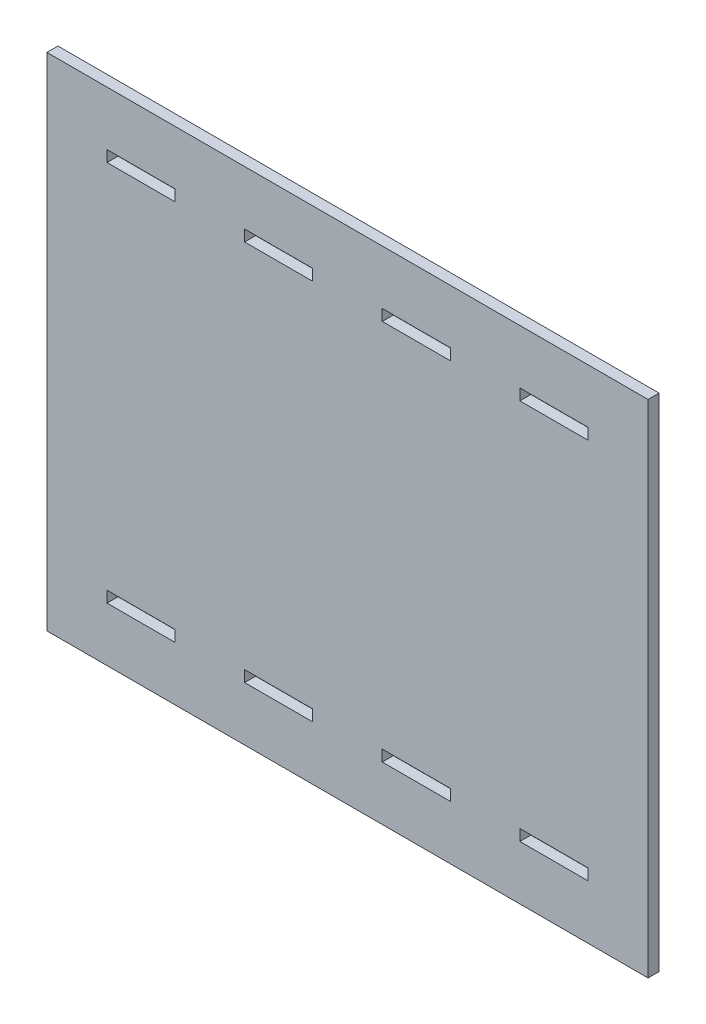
ISO-10303-21;
HEADER;
FILE_DESCRIPTION(('STEP AP214'),'2;1');
FILE_NAME('part.step','',(''),(''),'','','');
FILE_SCHEMA(('AUTOMOTIVE_DESIGN { 1 0 10303 214 1 1 1 1 }'));
ENDSEC;
DATA;
#1=APPLICATION_CONTEXT('core data for automotive mechanical design processes');
#2=APPLICATION_PROTOCOL_DEFINITION('international standard','automotive_design',2000,#1);
#3=PRODUCT_CONTEXT('',#1,'mechanical');
#4=PRODUCT('Part','Part','',(#3));
#5=PRODUCT_RELATED_PRODUCT_CATEGORY('part','',(#4));
#6=PRODUCT_DEFINITION_FORMATION('','',#4);
#7=PRODUCT_DEFINITION_CONTEXT('part definition',#1,'design');
#8=PRODUCT_DEFINITION('design','',#6,#7);
#9=PRODUCT_DEFINITION_SHAPE('','',#8);
#10=(LENGTH_UNIT() NAMED_UNIT(*) SI_UNIT(.MILLI.,.METRE.));
#11=(NAMED_UNIT(*) PLANE_ANGLE_UNIT() SI_UNIT($,.RADIAN.));
#12=(NAMED_UNIT(*) SI_UNIT($,.STERADIAN.) SOLID_ANGLE_UNIT());
#13=UNCERTAINTY_MEASURE_WITH_UNIT(LENGTH_MEASURE(1.E-05),#10,'distance_accuracy_value','');
#14=(GEOMETRIC_REPRESENTATION_CONTEXT(3) GLOBAL_UNCERTAINTY_ASSIGNED_CONTEXT((#13)) GLOBAL_UNIT_ASSIGNED_CONTEXT((#10,
#11,#12)) REPRESENTATION_CONTEXT('',''));
#15=CARTESIAN_POINT('',(0.,0.,0.));
#16=DIRECTION('',(0.,0.,1.));
#17=DIRECTION('',(1.,0.,0.));
#18=AXIS2_PLACEMENT_3D('',#15,#16,#17);
#19=CARTESIAN_POINT('',(150.,125.,5.5));
#20=DIRECTION('',(-1.,0.,0.));
#21=DIRECTION('',(0.,0.,1.));
#22=AXIS2_PLACEMENT_3D('',#19,#20,#21);
#23=PLANE('',#22);
#24=DIRECTION('',(0.,1.,0.));
#25=VECTOR('',#24,1.);
#26=CARTESIAN_POINT('',(150.,125.,0.));
#27=LINE('',#26,#25);
#28=CARTESIAN_POINT('',(150.,-125.,0.));
#29=VERTEX_POINT('',#28);
#30=CARTESIAN_POINT('',(150.,125.,0.));
#31=VERTEX_POINT('',#30);
#32=EDGE_CURVE('E527',#29,#31,#27,.T.);
#33=ORIENTED_EDGE('',*,*,#32,.T.);
#34=DIRECTION('',(0.,0.,-1.));
#35=VECTOR('',#34,1.);
#36=CARTESIAN_POINT('',(150.,125.,5.5));
#37=LINE('',#36,#35);
#38=CARTESIAN_POINT('',(150.,125.,5.5));
#39=VERTEX_POINT('',#38);
#40=EDGE_CURVE('E11',#39,#31,#37,.T.);
#41=ORIENTED_EDGE('',*,*,#40,.F.);
#42=DIRECTION('',(0.,1.,0.));
#43=VECTOR('',#42,1.);
#44=CARTESIAN_POINT('',(150.,125.,5.5));
#45=LINE('',#44,#43);
#46=CARTESIAN_POINT('',(150.,-125.,5.5));
#47=VERTEX_POINT('',#46);
#48=EDGE_CURVE('E534',#47,#39,#45,.T.);
#49=ORIENTED_EDGE('',*,*,#48,.F.);
#50=DIRECTION('',(0.,0.,-1.));
#51=VECTOR('',#50,1.);
#52=CARTESIAN_POINT('',(150.,-125.,5.5));
#53=LINE('',#52,#51);
#54=EDGE_CURVE('E544',#47,#29,#53,.T.);
#55=ORIENTED_EDGE('',*,*,#54,.T.);
#56=EDGE_LOOP('',(#33,#41,#49,#55));
#57=FACE_BOUND('',#56,.T.);
#58=ADVANCED_FACE('F42',(#57),#23,.F.);
#59=CARTESIAN_POINT('',(-150.,125.,5.5));
#60=DIRECTION('',(0.,-1.,0.));
#61=DIRECTION('',(0.,0.,-1.));
#62=AXIS2_PLACEMENT_3D('',#59,#60,#61);
#63=PLANE('',#62);
#64=DIRECTION('',(-1.,0.,0.));
#65=VECTOR('',#64,1.);
#66=CARTESIAN_POINT('',(-150.,125.,0.));
#67=LINE('',#66,#65);
#68=CARTESIAN_POINT('',(-150.,125.,0.));
#69=VERTEX_POINT('',#68);
#70=EDGE_CURVE('E547',#31,#69,#67,.T.);
#71=ORIENTED_EDGE('',*,*,#70,.T.);
#72=DIRECTION('',(0.,0.,-1.));
#73=VECTOR('',#72,1.);
#74=CARTESIAN_POINT('',(-150.,125.,5.5));
#75=LINE('',#74,#73);
#76=CARTESIAN_POINT('',(-150.,125.,5.5));
#77=VERTEX_POINT('',#76);
#78=EDGE_CURVE('E49',#77,#69,#75,.T.);
#79=ORIENTED_EDGE('',*,*,#78,.F.);
#80=DIRECTION('',(-1.,0.,0.));
#81=VECTOR('',#80,1.);
#82=CARTESIAN_POINT('',(-150.,125.,5.5));
#83=LINE('',#82,#81);
#84=EDGE_CURVE('E537',#39,#77,#83,.T.);
#85=ORIENTED_EDGE('',*,*,#84,.F.);
#86=ORIENTED_EDGE('',*,*,#40,.T.);
#87=EDGE_LOOP('',(#71,#79,#85,#86));
#88=FACE_BOUND('',#87,.T.);
#89=ADVANCED_FACE('F576',(#88),#63,.F.);
#90=CARTESIAN_POINT('',(-150.,125.,5.5));
#91=DIRECTION('',(1.,0.,0.));
#92=DIRECTION('',(0.,1.,0.));
#93=AXIS2_PLACEMENT_3D('',#90,#91,#92);
#94=PLANE('',#93);
#95=DIRECTION('',(0.,-1.,0.));
#96=VECTOR('',#95,1.);
#97=CARTESIAN_POINT('',(-150.,125.,0.));
#98=LINE('',#97,#96);
#99=CARTESIAN_POINT('',(-150.,-125.,0.));
#100=VERTEX_POINT('',#99);
#101=EDGE_CURVE('E549',#69,#100,#98,.T.);
#102=ORIENTED_EDGE('',*,*,#101,.T.);
#103=DIRECTION('',(0.,0.,-1.));
#104=VECTOR('',#103,1.);
#105=CARTESIAN_POINT('',(-150.,-125.,5.5));
#106=LINE('',#105,#104);
#107=CARTESIAN_POINT('',(-150.,-125.,5.5));
#108=VERTEX_POINT('',#107);
#109=EDGE_CURVE('E554',#108,#100,#106,.T.);
#110=ORIENTED_EDGE('',*,*,#109,.F.);
#111=DIRECTION('',(0.,-1.,0.));
#112=VECTOR('',#111,1.);
#113=CARTESIAN_POINT('',(-150.,125.,5.5));
#114=LINE('',#113,#112);
#115=EDGE_CURVE('E540',#77,#108,#114,.T.);
#116=ORIENTED_EDGE('',*,*,#115,.F.);
#117=ORIENTED_EDGE('',*,*,#78,.T.);
#118=EDGE_LOOP('',(#102,#110,#116,#117));
#119=FACE_BOUND('',#118,.T.);
#120=ADVANCED_FACE('F561',(#119),#94,.F.);
#121=CARTESIAN_POINT('',(-150.,-125.,5.5));
#122=DIRECTION('',(0.,1.,0.));
#123=DIRECTION('',(0.,0.,1.));
#124=AXIS2_PLACEMENT_3D('',#121,#122,#123);
#125=PLANE('',#124);
#126=DIRECTION('',(1.,0.,0.));
#127=VECTOR('',#126,1.);
#128=CARTESIAN_POINT('',(-150.,-125.,0.));
#129=LINE('',#128,#127);
#130=EDGE_CURVE('E538',#100,#29,#129,.T.);
#131=ORIENTED_EDGE('',*,*,#130,.T.);
#132=ORIENTED_EDGE('',*,*,#54,.F.);
#133=DIRECTION('',(1.,0.,0.));
#134=VECTOR('',#133,1.);
#135=CARTESIAN_POINT('',(-150.,-125.,5.5));
#136=LINE('',#135,#134);
#137=EDGE_CURVE('E542',#108,#47,#136,.T.);
#138=ORIENTED_EDGE('',*,*,#137,.F.);
#139=ORIENTED_EDGE('',*,*,#109,.T.);
#140=EDGE_LOOP('',(#131,#132,#138,#139));
#141=FACE_BOUND('',#140,.T.);
#142=ADVANCED_FACE('F570',(#141),#125,.F.);
#143=CARTESIAN_POINT('',(0.,0.,5.5));
#144=DIRECTION('',(0.,0.,1.));
#145=DIRECTION('',(1.,0.,0.));
#146=AXIS2_PLACEMENT_3D('',#143,#144,#145);
#147=PLANE('',#146);
#148=DIRECTION('',(0.,-1.,0.));
#149=VECTOR('',#148,1.);
#150=CARTESIAN_POINT('',(-120.,98.,5.5));
#151=LINE('',#150,#149);
#152=CARTESIAN_POINT('',(-120.,98.,5.5));
#153=VERTEX_POINT('',#152);
#154=CARTESIAN_POINT('',(-120.,92.4,5.5));
#155=VERTEX_POINT('',#154);
#156=EDGE_CURVE('E56',#153,#155,#151,.T.);
#157=ORIENTED_EDGE('',*,*,#156,.F.);
#158=DIRECTION('',(-1.,0.,0.));
#159=VECTOR('',#158,1.);
#160=CARTESIAN_POINT('',(-120.,98.,5.5));
#161=LINE('',#160,#159);
#162=CARTESIAN_POINT('',(-86.,98.,5.5));
#163=VERTEX_POINT('',#162);
#164=EDGE_CURVE('E417',#163,#153,#161,.T.);
#165=ORIENTED_EDGE('',*,*,#164,.F.);
#166=DIRECTION('',(0.,1.,0.));
#167=VECTOR('',#166,1.);
#168=CARTESIAN_POINT('',(-86.,98.,5.5));
#169=LINE('',#168,#167);
#170=CARTESIAN_POINT('',(-86.,92.4,5.5));
#171=VERTEX_POINT('',#170);
#172=EDGE_CURVE('E420',#171,#163,#169,.T.);
#173=ORIENTED_EDGE('',*,*,#172,.F.);
#174=DIRECTION('',(1.,0.,0.));
#175=VECTOR('',#174,1.);
#176=CARTESIAN_POINT('',(-120.,92.4,5.5));
#177=LINE('',#176,#175);
#178=EDGE_CURVE('E424',#155,#171,#177,.T.);
#179=ORIENTED_EDGE('',*,*,#178,.F.);
#180=EDGE_LOOP('',(#157,#165,#173,#179));
#181=FACE_BOUND('',#180,.T.);
#182=DIRECTION('',(0.,-1.,0.));
#183=VECTOR('',#182,1.);
#184=CARTESIAN_POINT('',(86.,-92.3999999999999,5.5));
#185=LINE('',#184,#183);
#186=CARTESIAN_POINT('',(86.,-92.3999999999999,5.5));
#187=VERTEX_POINT('',#186);
#188=CARTESIAN_POINT('',(86.,-97.9999999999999,5.5));
#189=VERTEX_POINT('',#188);
#190=EDGE_CURVE('E64',#187,#189,#185,.T.);
#191=ORIENTED_EDGE('',*,*,#190,.F.);
#192=DIRECTION('',(-1.,0.,0.));
#193=VECTOR('',#192,1.);
#194=CARTESIAN_POINT('',(86.,-92.3999999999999,5.5));
#195=LINE('',#194,#193);
#196=CARTESIAN_POINT('',(120.,-92.3999999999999,5.5));
#197=VERTEX_POINT('',#196);
#198=EDGE_CURVE('E389',#197,#187,#195,.T.);
#199=ORIENTED_EDGE('',*,*,#198,.F.);
#200=DIRECTION('',(0.,1.,0.));
#201=VECTOR('',#200,1.);
#202=CARTESIAN_POINT('',(120.,-92.3999999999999,5.5));
#203=LINE('',#202,#201);
#204=CARTESIAN_POINT('',(120.,-97.9999999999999,5.5));
#205=VERTEX_POINT('',#204);
#206=EDGE_CURVE('E392',#205,#197,#203,.T.);
#207=ORIENTED_EDGE('',*,*,#206,.F.);
#208=DIRECTION('',(1.,0.,0.));
#209=VECTOR('',#208,1.);
#210=CARTESIAN_POINT('',(86.,-97.9999999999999,5.5));
#211=LINE('',#210,#209);
#212=EDGE_CURVE('E396',#189,#205,#211,.T.);
#213=ORIENTED_EDGE('',*,*,#212,.F.);
#214=EDGE_LOOP('',(#191,#199,#207,#213));
#215=FACE_BOUND('',#214,.T.);
#216=DIRECTION('',(0.,-1.,0.));
#217=VECTOR('',#216,1.);
#218=CARTESIAN_POINT('',(17.34,-92.4000000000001,5.5));
#219=LINE('',#218,#217);
#220=CARTESIAN_POINT('',(17.34,-92.4000000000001,5.5));
#221=VERTEX_POINT('',#220);
#222=CARTESIAN_POINT('',(17.34,-98.0000000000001,5.5));
#223=VERTEX_POINT('',#222);
#224=EDGE_CURVE('E448',#221,#223,#219,.T.);
#225=ORIENTED_EDGE('',*,*,#224,.F.);
#226=DIRECTION('',(-1.,0.,0.));
#227=VECTOR('',#226,1.);
#228=CARTESIAN_POINT('',(17.34,-92.4000000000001,5.5));
#229=LINE('',#228,#227);
#230=CARTESIAN_POINT('',(51.34,-92.4000000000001,5.5));
#231=VERTEX_POINT('',#230);
#232=EDGE_CURVE('E481',#231,#221,#229,.T.);
#233=ORIENTED_EDGE('',*,*,#232,.F.);
#234=DIRECTION('',(0.,1.,0.));
#235=VECTOR('',#234,1.);
#236=CARTESIAN_POINT('',(51.34,-92.4000000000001,5.5));
#237=LINE('',#236,#235);
#238=CARTESIAN_POINT('',(51.34,-98.0000000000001,5.5));
#239=VERTEX_POINT('',#238);
#240=EDGE_CURVE('E484',#239,#231,#237,.T.);
#241=ORIENTED_EDGE('',*,*,#240,.F.);
#242=DIRECTION('',(1.,0.,0.));
#243=VECTOR('',#242,1.);
#244=CARTESIAN_POINT('',(17.34,-98.0000000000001,5.5));
#245=LINE('',#244,#243);
#246=EDGE_CURVE('E488',#223,#239,#245,.T.);
#247=ORIENTED_EDGE('',*,*,#246,.F.);
#248=EDGE_LOOP('',(#225,#233,#241,#247));
#249=FACE_BOUND('',#248,.T.);
#250=DIRECTION('',(0.,-1.,0.));
#251=VECTOR('',#250,1.);
#252=CARTESIAN_POINT('',(-120.,-92.3999999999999,5.5));
#253=LINE('',#252,#251);
#254=CARTESIAN_POINT('',(-120.,-92.3999999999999,5.5));
#255=VERTEX_POINT('',#254);
#256=CARTESIAN_POINT('',(-120.,-97.9999999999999,5.5));
#257=VERTEX_POINT('',#256);
#258=EDGE_CURVE('E459',#255,#257,#253,.T.);
#259=ORIENTED_EDGE('',*,*,#258,.F.);
#260=DIRECTION('',(-1.,0.,0.));
#261=VECTOR('',#260,1.);
#262=CARTESIAN_POINT('',(-120.,-92.3999999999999,5.5));
#263=LINE('',#262,#261);
#264=CARTESIAN_POINT('',(-86.,-92.3999999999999,5.5));
#265=VERTEX_POINT('',#264);
#266=EDGE_CURVE('E449',#265,#255,#263,.T.);
#267=ORIENTED_EDGE('',*,*,#266,.F.);
#268=DIRECTION('',(0.,1.,0.));
#269=VECTOR('',#268,1.);
#270=CARTESIAN_POINT('',(-86.,-92.3999999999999,5.5));
#271=LINE('',#270,#269);
#272=CARTESIAN_POINT('',(-86.,-97.9999999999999,5.5));
#273=VERTEX_POINT('',#272);
#274=EDGE_CURVE('E452',#273,#265,#271,.T.);
#275=ORIENTED_EDGE('',*,*,#274,.F.);
#276=DIRECTION('',(1.,0.,0.));
#277=VECTOR('',#276,1.);
#278=CARTESIAN_POINT('',(-120.,-97.9999999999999,5.5));
#279=LINE('',#278,#277);
#280=EDGE_CURVE('E456',#257,#273,#279,.T.);
#281=ORIENTED_EDGE('',*,*,#280,.F.);
#282=EDGE_LOOP('',(#259,#267,#275,#281));
#283=FACE_BOUND('',#282,.T.);
#284=DIRECTION('',(0.,-1.,0.));
#285=VECTOR('',#284,1.);
#286=CARTESIAN_POINT('',(-51.34,98.,5.5));
#287=LINE('',#286,#285);
#288=CARTESIAN_POINT('',(-51.34,98.,5.5));
#289=VERTEX_POINT('',#288);
#290=CARTESIAN_POINT('',(-51.34,92.4,5.5));
#291=VERTEX_POINT('',#290);
#292=EDGE_CURVE('E277',#289,#291,#287,.T.);
#293=ORIENTED_EDGE('',*,*,#292,.F.);
#294=DIRECTION('',(-1.,0.,0.));
#295=VECTOR('',#294,1.);
#296=CARTESIAN_POINT('',(-51.34,98.,5.5));
#297=LINE('',#296,#295);
#298=CARTESIAN_POINT('',(-17.34,98.,5.5));
#299=VERTEX_POINT('',#298);
#300=EDGE_CURVE('E288',#299,#289,#297,.T.);
#301=ORIENTED_EDGE('',*,*,#300,.F.);
#302=DIRECTION('',(0.,1.,0.));
#303=VECTOR('',#302,1.);
#304=CARTESIAN_POINT('',(-17.34,98.,5.5));
#305=LINE('',#304,#303);
#306=CARTESIAN_POINT('',(-17.34,92.4,5.5));
#307=VERTEX_POINT('',#306);
#308=EDGE_CURVE('E293',#307,#299,#305,.T.);
#309=ORIENTED_EDGE('',*,*,#308,.F.);
#310=DIRECTION('',(1.,0.,0.));
#311=VECTOR('',#310,1.);
#312=CARTESIAN_POINT('',(-51.34,92.4,5.5));
#313=LINE('',#312,#311);
#314=EDGE_CURVE('E299',#291,#307,#313,.T.);
#315=ORIENTED_EDGE('',*,*,#314,.F.);
#316=EDGE_LOOP('',(#293,#301,#309,#315));
#317=FACE_BOUND('',#316,.T.);
#318=DIRECTION('',(0.,-1.,0.));
#319=VECTOR('',#318,1.);
#320=CARTESIAN_POINT('',(17.34,98.,5.5));
#321=LINE('',#320,#319);
#322=CARTESIAN_POINT('',(17.34,98.,5.5));
#323=VERTEX_POINT('',#322);
#324=CARTESIAN_POINT('',(17.34,92.4,5.5));
#325=VERTEX_POINT('',#324);
#326=EDGE_CURVE('E285',#323,#325,#321,.T.);
#327=ORIENTED_EDGE('',*,*,#326,.F.);
#328=DIRECTION('',(-1.,0.,0.));
#329=VECTOR('',#328,1.);
#330=CARTESIAN_POINT('',(17.34,98.,5.5));
#331=LINE('',#330,#329);
#332=CARTESIAN_POINT('',(51.34,98.,5.5));
#333=VERTEX_POINT('',#332);
#334=EDGE_CURVE('E328',#333,#323,#331,.T.);
#335=ORIENTED_EDGE('',*,*,#334,.F.);
#336=DIRECTION('',(0.,1.,0.));
#337=VECTOR('',#336,1.);
#338=CARTESIAN_POINT('',(51.34,98.,5.5));
#339=LINE('',#338,#337);
#340=CARTESIAN_POINT('',(51.34,92.4,5.5));
#341=VERTEX_POINT('',#340);
#342=EDGE_CURVE('E331',#341,#333,#339,.T.);
#343=ORIENTED_EDGE('',*,*,#342,.F.);
#344=DIRECTION('',(1.,0.,0.));
#345=VECTOR('',#344,1.);
#346=CARTESIAN_POINT('',(17.34,92.4,5.5));
#347=LINE('',#346,#345);
#348=EDGE_CURVE('E335',#325,#341,#347,.T.);
#349=ORIENTED_EDGE('',*,*,#348,.F.);
#350=EDGE_LOOP('',(#327,#335,#343,#349));
#351=FACE_BOUND('',#350,.T.);
#352=DIRECTION('',(0.,-1.,0.));
#353=VECTOR('',#352,1.);
#354=CARTESIAN_POINT('',(86.,98.,5.5));
#355=LINE('',#354,#353);
#356=CARTESIAN_POINT('',(86.,98.,5.5));
#357=VERTEX_POINT('',#356);
#358=CARTESIAN_POINT('',(86.,92.4,5.5));
#359=VERTEX_POINT('',#358);
#360=EDGE_CURVE('E327',#357,#359,#355,.T.);
#361=ORIENTED_EDGE('',*,*,#360,.F.);
#362=DIRECTION('',(-1.,0.,0.));
#363=VECTOR('',#362,1.);
#364=CARTESIAN_POINT('',(86.,98.,5.5));
#365=LINE('',#364,#363);
#366=CARTESIAN_POINT('',(120.,98.,5.5));
#367=VERTEX_POINT('',#366);
#368=EDGE_CURVE('E359',#367,#357,#365,.T.);
#369=ORIENTED_EDGE('',*,*,#368,.F.);
#370=DIRECTION('',(0.,1.,0.));
#371=VECTOR('',#370,1.);
#372=CARTESIAN_POINT('',(120.,98.,5.5));
#373=LINE('',#372,#371);
#374=CARTESIAN_POINT('',(120.,92.4,5.5));
#375=VERTEX_POINT('',#374);
#376=EDGE_CURVE('E362',#375,#367,#373,.T.);
#377=ORIENTED_EDGE('',*,*,#376,.F.);
#378=DIRECTION('',(1.,0.,0.));
#379=VECTOR('',#378,1.);
#380=CARTESIAN_POINT('',(86.,92.4,5.5));
#381=LINE('',#380,#379);
#382=EDGE_CURVE('E366',#359,#375,#381,.T.);
#383=ORIENTED_EDGE('',*,*,#382,.F.);
#384=EDGE_LOOP('',(#361,#369,#377,#383));
#385=FACE_BOUND('',#384,.T.);
#386=DIRECTION('',(0.,-1.,0.));
#387=VECTOR('',#386,1.);
#388=CARTESIAN_POINT('',(-51.34,-92.3999999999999,5.5));
#389=LINE('',#388,#387);
#390=CARTESIAN_POINT('',(-51.34,-92.3999999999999,5.5));
#391=VERTEX_POINT('',#390);
#392=CARTESIAN_POINT('',(-51.34,-97.9999999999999,5.5));
#393=VERTEX_POINT('',#392);
#394=EDGE_CURVE('E461',#391,#393,#389,.T.);
#395=ORIENTED_EDGE('',*,*,#394,.F.);
#396=DIRECTION('',(-1.,0.,0.));
#397=VECTOR('',#396,1.);
#398=CARTESIAN_POINT('',(-51.34,-92.3999999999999,5.5));
#399=LINE('',#398,#397);
#400=CARTESIAN_POINT('',(-17.34,-92.4,5.5));
#401=VERTEX_POINT('',#400);
#402=EDGE_CURVE('E506',#401,#391,#399,.T.);
#403=ORIENTED_EDGE('',*,*,#402,.F.);
#404=DIRECTION('',(0.,1.,0.));
#405=VECTOR('',#404,1.);
#406=CARTESIAN_POINT('',(-17.34,-92.4,5.5));
#407=LINE('',#406,#405);
#408=CARTESIAN_POINT('',(-17.34,-97.9999999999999,5.5));
#409=VERTEX_POINT('',#408);
#410=EDGE_CURVE('E520',#409,#401,#407,.T.);
#411=ORIENTED_EDGE('',*,*,#410,.F.);
#412=DIRECTION('',(1.,0.,0.));
#413=VECTOR('',#412,1.);
#414=CARTESIAN_POINT('',(-51.34,-97.9999999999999,5.5));
#415=LINE('',#414,#413);
#416=EDGE_CURVE('E517',#393,#409,#415,.T.);
#417=ORIENTED_EDGE('',*,*,#416,.F.);
#418=EDGE_LOOP('',(#395,#403,#411,#417));
#419=FACE_BOUND('',#418,.T.);
#420=ORIENTED_EDGE('',*,*,#48,.T.);
#421=ORIENTED_EDGE('',*,*,#84,.T.);
#422=ORIENTED_EDGE('',*,*,#115,.T.);
#423=ORIENTED_EDGE('',*,*,#137,.T.);
#424=EDGE_LOOP('',(#420,#421,#422,#423));
#425=FACE_BOUND('',#424,.T.);
#426=ADVANCED_FACE('F296',(#181,#215,#249,#283,#317,#351,#385,#419,#425),#147,.T.);
#427=CARTESIAN_POINT('',(0.,0.,0.));
#428=DIRECTION('',(0.,0.,1.));
#429=DIRECTION('',(1.,0.,0.));
#430=AXIS2_PLACEMENT_3D('',#427,#428,#429);
#431=PLANE('',#430);
#432=DIRECTION('',(-1.,0.,0.));
#433=VECTOR('',#432,1.);
#434=CARTESIAN_POINT('',(-120.,98.,0.));
#435=LINE('',#434,#433);
#436=CARTESIAN_POINT('',(-86.,98.,0.));
#437=VERTEX_POINT('',#436);
#438=CARTESIAN_POINT('',(-120.,98.,0.));
#439=VERTEX_POINT('',#438);
#440=EDGE_CURVE('E413',#437,#439,#435,.T.);
#441=ORIENTED_EDGE('',*,*,#440,.T.);
#442=DIRECTION('',(0.,-1.,0.));
#443=VECTOR('',#442,1.);
#444=CARTESIAN_POINT('',(-120.,98.,0.));
#445=LINE('',#444,#443);
#446=CARTESIAN_POINT('',(-120.,92.4,0.));
#447=VERTEX_POINT('',#446);
#448=EDGE_CURVE('E421',#439,#447,#445,.T.);
#449=ORIENTED_EDGE('',*,*,#448,.T.);
#450=DIRECTION('',(1.,0.,0.));
#451=VECTOR('',#450,1.);
#452=CARTESIAN_POINT('',(-120.,92.4,0.));
#453=LINE('',#452,#451);
#454=CARTESIAN_POINT('',(-86.,92.4,0.));
#455=VERTEX_POINT('',#454);
#456=EDGE_CURVE('E433',#447,#455,#453,.T.);
#457=ORIENTED_EDGE('',*,*,#456,.T.);
#458=DIRECTION('',(0.,1.,0.));
#459=VECTOR('',#458,1.);
#460=CARTESIAN_POINT('',(-86.,98.,0.));
#461=LINE('',#460,#459);
#462=EDGE_CURVE('E430',#455,#437,#461,.T.);
#463=ORIENTED_EDGE('',*,*,#462,.T.);
#464=EDGE_LOOP('',(#441,#449,#457,#463));
#465=FACE_BOUND('',#464,.T.);
#466=DIRECTION('',(-1.,0.,0.));
#467=VECTOR('',#466,1.);
#468=CARTESIAN_POINT('',(86.,-92.3999999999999,0.));
#469=LINE('',#468,#467);
#470=CARTESIAN_POINT('',(120.,-92.3999999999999,0.));
#471=VERTEX_POINT('',#470);
#472=CARTESIAN_POINT('',(86.,-92.3999999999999,0.));
#473=VERTEX_POINT('',#472);
#474=EDGE_CURVE('E382',#471,#473,#469,.T.);
#475=ORIENTED_EDGE('',*,*,#474,.T.);
#476=DIRECTION('',(0.,-1.,0.));
#477=VECTOR('',#476,1.);
#478=CARTESIAN_POINT('',(86.,-92.3999999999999,0.));
#479=LINE('',#478,#477);
#480=CARTESIAN_POINT('',(86.,-97.9999999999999,0.));
#481=VERTEX_POINT('',#480);
#482=EDGE_CURVE('E393',#473,#481,#479,.T.);
#483=ORIENTED_EDGE('',*,*,#482,.T.);
#484=DIRECTION('',(1.,0.,0.));
#485=VECTOR('',#484,1.);
#486=CARTESIAN_POINT('',(86.,-97.9999999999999,0.));
#487=LINE('',#486,#485);
#488=CARTESIAN_POINT('',(120.,-97.9999999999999,0.));
#489=VERTEX_POINT('',#488);
#490=EDGE_CURVE('E406',#481,#489,#487,.T.);
#491=ORIENTED_EDGE('',*,*,#490,.T.);
#492=DIRECTION('',(0.,1.,0.));
#493=VECTOR('',#492,1.);
#494=CARTESIAN_POINT('',(120.,-92.3999999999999,0.));
#495=LINE('',#494,#493);
#496=EDGE_CURVE('E403',#489,#471,#495,.T.);
#497=ORIENTED_EDGE('',*,*,#496,.T.);
#498=EDGE_LOOP('',(#475,#483,#491,#497));
#499=FACE_BOUND('',#498,.T.);
#500=DIRECTION('',(-1.,0.,0.));
#501=VECTOR('',#500,1.);
#502=CARTESIAN_POINT('',(17.34,-92.4000000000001,0.));
#503=LINE('',#502,#501);
#504=CARTESIAN_POINT('',(51.34,-92.4000000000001,0.));
#505=VERTEX_POINT('',#504);
#506=CARTESIAN_POINT('',(17.34,-92.4000000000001,0.));
#507=VERTEX_POINT('',#506);
#508=EDGE_CURVE('E475',#505,#507,#503,.T.);
#509=ORIENTED_EDGE('',*,*,#508,.T.);
#510=DIRECTION('',(0.,-1.,0.));
#511=VECTOR('',#510,1.);
#512=CARTESIAN_POINT('',(17.34,-92.4000000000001,0.));
#513=LINE('',#512,#511);
#514=CARTESIAN_POINT('',(17.34,-98.0000000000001,0.));
#515=VERTEX_POINT('',#514);
#516=EDGE_CURVE('E485',#507,#515,#513,.T.);
#517=ORIENTED_EDGE('',*,*,#516,.T.);
#518=DIRECTION('',(1.,0.,0.));
#519=VECTOR('',#518,1.);
#520=CARTESIAN_POINT('',(17.34,-98.0000000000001,0.));
#521=LINE('',#520,#519);
#522=CARTESIAN_POINT('',(51.34,-98.0000000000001,0.));
#523=VERTEX_POINT('',#522);
#524=EDGE_CURVE('E497',#515,#523,#521,.T.);
#525=ORIENTED_EDGE('',*,*,#524,.T.);
#526=DIRECTION('',(0.,1.,0.));
#527=VECTOR('',#526,1.);
#528=CARTESIAN_POINT('',(51.34,-92.4000000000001,0.));
#529=LINE('',#528,#527);
#530=EDGE_CURVE('E494',#523,#505,#529,.T.);
#531=ORIENTED_EDGE('',*,*,#530,.T.);
#532=EDGE_LOOP('',(#509,#517,#525,#531));
#533=FACE_BOUND('',#532,.T.);
#534=DIRECTION('',(-1.,0.,0.));
#535=VECTOR('',#534,1.);
#536=CARTESIAN_POINT('',(-120.,-92.3999999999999,0.));
#537=LINE('',#536,#535);
#538=CARTESIAN_POINT('',(-86.,-92.3999999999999,0.));
#539=VERTEX_POINT('',#538);
#540=CARTESIAN_POINT('',(-120.,-92.3999999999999,0.));
#541=VERTEX_POINT('',#540);
#542=EDGE_CURVE('E441',#539,#541,#537,.T.);
#543=ORIENTED_EDGE('',*,*,#542,.T.);
#544=DIRECTION('',(0.,-1.,0.));
#545=VECTOR('',#544,1.);
#546=CARTESIAN_POINT('',(-120.,-92.3999999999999,0.));
#547=LINE('',#546,#545);
#548=CARTESIAN_POINT('',(-120.,-97.9999999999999,0.));
#549=VERTEX_POINT('',#548);
#550=EDGE_CURVE('E453',#541,#549,#547,.T.);
#551=ORIENTED_EDGE('',*,*,#550,.T.);
#552=DIRECTION('',(1.,0.,0.));
#553=VECTOR('',#552,1.);
#554=CARTESIAN_POINT('',(-120.,-97.9999999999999,0.));
#555=LINE('',#554,#553);
#556=CARTESIAN_POINT('',(-86.,-97.9999999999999,0.));
#557=VERTEX_POINT('',#556);
#558=EDGE_CURVE('E467',#549,#557,#555,.T.);
#559=ORIENTED_EDGE('',*,*,#558,.T.);
#560=DIRECTION('',(0.,1.,0.));
#561=VECTOR('',#560,1.);
#562=CARTESIAN_POINT('',(-86.,-92.3999999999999,0.));
#563=LINE('',#562,#561);
#564=EDGE_CURVE('E464',#557,#539,#563,.T.);
#565=ORIENTED_EDGE('',*,*,#564,.T.);
#566=EDGE_LOOP('',(#543,#551,#559,#565));
#567=FACE_BOUND('',#566,.T.);
#568=DIRECTION('',(-1.,0.,0.));
#569=VECTOR('',#568,1.);
#570=CARTESIAN_POINT('',(-51.34,98.,0.));
#571=LINE('',#570,#569);
#572=CARTESIAN_POINT('',(-17.34,98.,0.));
#573=VERTEX_POINT('',#572);
#574=CARTESIAN_POINT('',(-51.34,98.,0.));
#575=VERTEX_POINT('',#574);
#576=EDGE_CURVE('E307',#573,#575,#571,.T.);
#577=ORIENTED_EDGE('',*,*,#576,.T.);
#578=DIRECTION('',(0.,-1.,0.));
#579=VECTOR('',#578,1.);
#580=CARTESIAN_POINT('',(-51.34,98.,0.));
#581=LINE('',#580,#579);
#582=CARTESIAN_POINT('',(-51.34,92.4,0.));
#583=VERTEX_POINT('',#582);
#584=EDGE_CURVE('E280',#575,#583,#581,.T.);
#585=ORIENTED_EDGE('',*,*,#584,.T.);
#586=DIRECTION('',(1.,0.,0.));
#587=VECTOR('',#586,1.);
#588=CARTESIAN_POINT('',(-51.34,92.4,0.));
#589=LINE('',#588,#587);
#590=CARTESIAN_POINT('',(-17.34,92.4,0.));
#591=VERTEX_POINT('',#590);
#592=EDGE_CURVE('E313',#583,#591,#589,.T.);
#593=ORIENTED_EDGE('',*,*,#592,.T.);
#594=DIRECTION('',(0.,1.,0.));
#595=VECTOR('',#594,1.);
#596=CARTESIAN_POINT('',(-17.34,98.,0.));
#597=LINE('',#596,#595);
#598=EDGE_CURVE('E309',#591,#573,#597,.T.);
#599=ORIENTED_EDGE('',*,*,#598,.T.);
#600=EDGE_LOOP('',(#577,#585,#593,#599));
#601=FACE_BOUND('',#600,.T.);
#602=DIRECTION('',(-1.,0.,0.));
#603=VECTOR('',#602,1.);
#604=CARTESIAN_POINT('',(17.34,98.,0.));
#605=LINE('',#604,#603);
#606=CARTESIAN_POINT('',(51.34,98.,0.));
#607=VERTEX_POINT('',#606);
#608=CARTESIAN_POINT('',(17.34,98.,0.));
#609=VERTEX_POINT('',#608);
#610=EDGE_CURVE('E320',#607,#609,#605,.T.);
#611=ORIENTED_EDGE('',*,*,#610,.T.);
#612=DIRECTION('',(0.,-1.,0.));
#613=VECTOR('',#612,1.);
#614=CARTESIAN_POINT('',(17.34,98.,0.));
#615=LINE('',#614,#613);
#616=CARTESIAN_POINT('',(17.34,92.4,0.));
#617=VERTEX_POINT('',#616);
#618=EDGE_CURVE('E332',#609,#617,#615,.T.);
#619=ORIENTED_EDGE('',*,*,#618,.T.);
#620=DIRECTION('',(1.,0.,0.));
#621=VECTOR('',#620,1.);
#622=CARTESIAN_POINT('',(17.34,92.4,0.));
#623=LINE('',#622,#621);
#624=CARTESIAN_POINT('',(51.34,92.4,0.));
#625=VERTEX_POINT('',#624);
#626=EDGE_CURVE('E344',#617,#625,#623,.T.);
#627=ORIENTED_EDGE('',*,*,#626,.T.);
#628=DIRECTION('',(0.,1.,0.));
#629=VECTOR('',#628,1.);
#630=CARTESIAN_POINT('',(51.34,98.,0.));
#631=LINE('',#630,#629);
#632=EDGE_CURVE('E341',#625,#607,#631,.T.);
#633=ORIENTED_EDGE('',*,*,#632,.T.);
#634=EDGE_LOOP('',(#611,#619,#627,#633));
#635=FACE_BOUND('',#634,.T.);
#636=DIRECTION('',(-1.,0.,0.));
#637=VECTOR('',#636,1.);
#638=CARTESIAN_POINT('',(86.,98.,0.));
#639=LINE('',#638,#637);
#640=CARTESIAN_POINT('',(120.,98.,0.));
#641=VERTEX_POINT('',#640);
#642=CARTESIAN_POINT('',(86.,98.,0.));
#643=VERTEX_POINT('',#642);
#644=EDGE_CURVE('E352',#641,#643,#639,.T.);
#645=ORIENTED_EDGE('',*,*,#644,.T.);
#646=DIRECTION('',(0.,-1.,0.));
#647=VECTOR('',#646,1.);
#648=CARTESIAN_POINT('',(86.,98.,0.));
#649=LINE('',#648,#647);
#650=CARTESIAN_POINT('',(86.,92.4,0.));
#651=VERTEX_POINT('',#650);
#652=EDGE_CURVE('E363',#643,#651,#649,.T.);
#653=ORIENTED_EDGE('',*,*,#652,.T.);
#654=DIRECTION('',(1.,0.,0.));
#655=VECTOR('',#654,1.);
#656=CARTESIAN_POINT('',(86.,92.4,0.));
#657=LINE('',#656,#655);
#658=CARTESIAN_POINT('',(120.,92.4,0.));
#659=VERTEX_POINT('',#658);
#660=EDGE_CURVE('E375',#651,#659,#657,.T.);
#661=ORIENTED_EDGE('',*,*,#660,.T.);
#662=DIRECTION('',(0.,1.,0.));
#663=VECTOR('',#662,1.);
#664=CARTESIAN_POINT('',(120.,98.,0.));
#665=LINE('',#664,#663);
#666=EDGE_CURVE('E372',#659,#641,#665,.T.);
#667=ORIENTED_EDGE('',*,*,#666,.T.);
#668=EDGE_LOOP('',(#645,#653,#661,#667));
#669=FACE_BOUND('',#668,.T.);
#670=DIRECTION('',(-1.,0.,0.));
#671=VECTOR('',#670,1.);
#672=CARTESIAN_POINT('',(-51.34,-92.3999999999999,0.));
#673=LINE('',#672,#671);
#674=CARTESIAN_POINT('',(-17.34,-92.4,0.));
#675=VERTEX_POINT('',#674);
#676=CARTESIAN_POINT('',(-51.34,-92.3999999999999,0.));
#677=VERTEX_POINT('',#676);
#678=EDGE_CURVE('E512',#675,#677,#673,.T.);
#679=ORIENTED_EDGE('',*,*,#678,.T.);
#680=DIRECTION('',(0.,-1.,0.));
#681=VECTOR('',#680,1.);
#682=CARTESIAN_POINT('',(-51.34,-92.3999999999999,0.));
#683=LINE('',#682,#681);
#684=CARTESIAN_POINT('',(-51.34,-97.9999999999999,0.));
#685=VERTEX_POINT('',#684);
#686=EDGE_CURVE('E502',#677,#685,#683,.T.);
#687=ORIENTED_EDGE('',*,*,#686,.T.);
#688=DIRECTION('',(1.,0.,0.));
#689=VECTOR('',#688,1.);
#690=CARTESIAN_POINT('',(-51.34,-97.9999999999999,0.));
#691=LINE('',#690,#689);
#692=CARTESIAN_POINT('',(-17.34,-97.9999999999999,0.));
#693=VERTEX_POINT('',#692);
#694=EDGE_CURVE('E505',#685,#693,#691,.T.);
#695=ORIENTED_EDGE('',*,*,#694,.T.);
#696=DIRECTION('',(0.,1.,0.));
#697=VECTOR('',#696,1.);
#698=CARTESIAN_POINT('',(-17.34,-92.4,0.));
#699=LINE('',#698,#697);
#700=EDGE_CURVE('E509',#693,#675,#699,.T.);
#701=ORIENTED_EDGE('',*,*,#700,.T.);
#702=EDGE_LOOP('',(#679,#687,#695,#701));
#703=FACE_BOUND('',#702,.T.);
#704=ORIENTED_EDGE('',*,*,#32,.F.);
#705=ORIENTED_EDGE('',*,*,#130,.F.);
#706=ORIENTED_EDGE('',*,*,#101,.F.);
#707=ORIENTED_EDGE('',*,*,#70,.F.);
#708=EDGE_LOOP('',(#704,#705,#706,#707));
#709=FACE_BOUND('',#708,.T.);
#710=ADVANCED_FACE('F567',(#465,#499,#533,#567,#601,#635,#669,#703,#709),#431,.F.);
#711=CARTESIAN_POINT('',(-51.34,-92.3999999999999,0.));
#712=DIRECTION('',(-1.,0.,0.));
#713=DIRECTION('',(0.,0.,1.));
#714=AXIS2_PLACEMENT_3D('',#711,#712,#713);
#715=PLANE('',#714);
#716=ORIENTED_EDGE('',*,*,#394,.T.);
#717=DIRECTION('',(0.,0.,1.));
#718=VECTOR('',#717,1.);
#719=CARTESIAN_POINT('',(-51.34,-97.9999999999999,0.));
#720=LINE('',#719,#718);
#721=EDGE_CURVE('E515',#685,#393,#720,.T.);
#722=ORIENTED_EDGE('',*,*,#721,.F.);
#723=ORIENTED_EDGE('',*,*,#686,.F.);
#724=DIRECTION('',(0.,0.,1.));
#725=VECTOR('',#724,1.);
#726=CARTESIAN_POINT('',(-51.34,-92.3999999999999,0.));
#727=LINE('',#726,#725);
#728=EDGE_CURVE('E525',#677,#391,#727,.T.);
#729=ORIENTED_EDGE('',*,*,#728,.T.);
#730=EDGE_LOOP('',(#716,#722,#723,#729));
#731=FACE_BOUND('',#730,.T.);
#732=ADVANCED_FACE('F588',(#731),#715,.F.);
#733=CARTESIAN_POINT('',(-51.34,-92.3999999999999,0.));
#734=DIRECTION('',(0.,1.,0.));
#735=DIRECTION('',(-1.,0.,0.));
#736=AXIS2_PLACEMENT_3D('',#733,#734,#735);
#737=PLANE('',#736);
#738=ORIENTED_EDGE('',*,*,#402,.T.);
#739=ORIENTED_EDGE('',*,*,#728,.F.);
#740=ORIENTED_EDGE('',*,*,#678,.F.);
#741=DIRECTION('',(0.,0.,1.));
#742=VECTOR('',#741,1.);
#743=CARTESIAN_POINT('',(-17.34,-92.4,0.));
#744=LINE('',#743,#742);
#745=EDGE_CURVE('E528',#675,#401,#744,.T.);
#746=ORIENTED_EDGE('',*,*,#745,.T.);
#747=EDGE_LOOP('',(#738,#739,#740,#746));
#748=FACE_BOUND('',#747,.T.);
#749=ADVANCED_FACE('F595',(#748),#737,.F.);
#750=CARTESIAN_POINT('',(-17.34,-92.4,0.));
#751=DIRECTION('',(1.,0.,0.));
#752=DIRECTION('',(0.,0.,-1.));
#753=AXIS2_PLACEMENT_3D('',#750,#751,#752);
#754=PLANE('',#753);
#755=ORIENTED_EDGE('',*,*,#410,.T.);
#756=ORIENTED_EDGE('',*,*,#745,.F.);
#757=ORIENTED_EDGE('',*,*,#700,.F.);
#758=DIRECTION('',(0.,0.,1.));
#759=VECTOR('',#758,1.);
#760=CARTESIAN_POINT('',(-17.34,-97.9999999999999,0.));
#761=LINE('',#760,#759);
#762=EDGE_CURVE('E530',#693,#409,#761,.T.);
#763=ORIENTED_EDGE('',*,*,#762,.T.);
#764=EDGE_LOOP('',(#755,#756,#757,#763));
#765=FACE_BOUND('',#764,.T.);
#766=ADVANCED_FACE('F601',(#765),#754,.F.);
#767=CARTESIAN_POINT('',(-51.34,-97.9999999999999,0.));
#768=DIRECTION('',(0.,-1.,0.));
#769=DIRECTION('',(0.,0.,-1.));
#770=AXIS2_PLACEMENT_3D('',#767,#768,#769);
#771=PLANE('',#770);
#772=ORIENTED_EDGE('',*,*,#416,.T.);
#773=ORIENTED_EDGE('',*,*,#762,.F.);
#774=ORIENTED_EDGE('',*,*,#694,.F.);
#775=ORIENTED_EDGE('',*,*,#721,.T.);
#776=EDGE_LOOP('',(#772,#773,#774,#775));
#777=FACE_BOUND('',#776,.T.);
#778=ADVANCED_FACE('F597',(#777),#771,.F.);
#779=CARTESIAN_POINT('',(86.,98.,0.));
#780=DIRECTION('',(-1.,0.,0.));
#781=DIRECTION('',(0.,0.,1.));
#782=AXIS2_PLACEMENT_3D('',#779,#780,#781);
#783=PLANE('',#782);
#784=ORIENTED_EDGE('',*,*,#360,.T.);
#785=DIRECTION('',(0.,0.,1.));
#786=VECTOR('',#785,1.);
#787=CARTESIAN_POINT('',(86.,92.4,0.));
#788=LINE('',#787,#786);
#789=EDGE_CURVE('E349',#651,#359,#788,.T.);
#790=ORIENTED_EDGE('',*,*,#789,.F.);
#791=ORIENTED_EDGE('',*,*,#652,.F.);
#792=DIRECTION('',(0.,0.,1.));
#793=VECTOR('',#792,1.);
#794=CARTESIAN_POINT('',(86.,98.,0.));
#795=LINE('',#794,#793);
#796=EDGE_CURVE('E357',#643,#357,#795,.T.);
#797=ORIENTED_EDGE('',*,*,#796,.T.);
#798=EDGE_LOOP('',(#784,#790,#791,#797));
#799=FACE_BOUND('',#798,.T.);
#800=ADVANCED_FACE('F600',(#799),#783,.F.);
#801=CARTESIAN_POINT('',(86.,98.,0.));
#802=DIRECTION('',(0.,1.,0.));
#803=DIRECTION('',(0.,0.,1.));
#804=AXIS2_PLACEMENT_3D('',#801,#802,#803);
#805=PLANE('',#804);
#806=ORIENTED_EDGE('',*,*,#368,.T.);
#807=ORIENTED_EDGE('',*,*,#796,.F.);
#808=ORIENTED_EDGE('',*,*,#644,.F.);
#809=DIRECTION('',(0.,0.,1.));
#810=VECTOR('',#809,1.);
#811=CARTESIAN_POINT('',(120.,98.,0.));
#812=LINE('',#811,#810);
#813=EDGE_CURVE('E355',#641,#367,#812,.T.);
#814=ORIENTED_EDGE('',*,*,#813,.T.);
#815=EDGE_LOOP('',(#806,#807,#808,#814));
#816=FACE_BOUND('',#815,.T.);
#817=ADVANCED_FACE('F672',(#816),#805,.F.);
#818=CARTESIAN_POINT('',(120.,98.,0.));
#819=DIRECTION('',(1.,0.,0.));
#820=DIRECTION('',(0.,0.,-1.));
#821=AXIS2_PLACEMENT_3D('',#818,#819,#820);
#822=PLANE('',#821);
#823=ORIENTED_EDGE('',*,*,#376,.T.);
#824=ORIENTED_EDGE('',*,*,#813,.F.);
#825=ORIENTED_EDGE('',*,*,#666,.F.);
#826=DIRECTION('',(0.,0.,1.));
#827=VECTOR('',#826,1.);
#828=CARTESIAN_POINT('',(120.,92.4,0.));
#829=LINE('',#828,#827);
#830=EDGE_CURVE('E353',#659,#375,#829,.T.);
#831=ORIENTED_EDGE('',*,*,#830,.T.);
#832=EDGE_LOOP('',(#823,#824,#825,#831));
#833=FACE_BOUND('',#832,.T.);
#834=ADVANCED_FACE('F675',(#833),#822,.F.);
#835=CARTESIAN_POINT('',(86.,92.4,0.));
#836=DIRECTION('',(0.,-1.,0.));
#837=DIRECTION('',(1.,0.,0.));
#838=AXIS2_PLACEMENT_3D('',#835,#836,#837);
#839=PLANE('',#838);
#840=ORIENTED_EDGE('',*,*,#382,.T.);
#841=ORIENTED_EDGE('',*,*,#830,.F.);
#842=ORIENTED_EDGE('',*,*,#660,.F.);
#843=ORIENTED_EDGE('',*,*,#789,.T.);
#844=EDGE_LOOP('',(#840,#841,#842,#843));
#845=FACE_BOUND('',#844,.T.);
#846=ADVANCED_FACE('F679',(#845),#839,.F.);
#847=CARTESIAN_POINT('',(17.34,98.,0.));
#848=DIRECTION('',(-1.,0.,0.));
#849=DIRECTION('',(0.,0.,1.));
#850=AXIS2_PLACEMENT_3D('',#847,#848,#849);
#851=PLANE('',#850);
#852=ORIENTED_EDGE('',*,*,#326,.T.);
#853=DIRECTION('',(0.,0.,1.));
#854=VECTOR('',#853,1.);
#855=CARTESIAN_POINT('',(17.34,92.4,0.));
#856=LINE('',#855,#854);
#857=EDGE_CURVE('E317',#617,#325,#856,.T.);
#858=ORIENTED_EDGE('',*,*,#857,.F.);
#859=ORIENTED_EDGE('',*,*,#618,.F.);
#860=DIRECTION('',(0.,0.,1.));
#861=VECTOR('',#860,1.);
#862=CARTESIAN_POINT('',(17.34,98.,0.));
#863=LINE('',#862,#861);
#864=EDGE_CURVE('E325',#609,#323,#863,.T.);
#865=ORIENTED_EDGE('',*,*,#864,.T.);
#866=EDGE_LOOP('',(#852,#858,#859,#865));
#867=FACE_BOUND('',#866,.T.);
#868=ADVANCED_FACE('F683',(#867),#851,.F.);
#869=CARTESIAN_POINT('',(17.34,98.,0.));
#870=DIRECTION('',(0.,1.,0.));
#871=DIRECTION('',(0.,0.,1.));
#872=AXIS2_PLACEMENT_3D('',#869,#870,#871);
#873=PLANE('',#872);
#874=ORIENTED_EDGE('',*,*,#334,.T.);
#875=ORIENTED_EDGE('',*,*,#864,.F.);
#876=ORIENTED_EDGE('',*,*,#610,.F.);
#877=DIRECTION('',(0.,0.,1.));
#878=VECTOR('',#877,1.);
#879=CARTESIAN_POINT('',(51.34,98.,0.));
#880=LINE('',#879,#878);
#881=EDGE_CURVE('E323',#607,#333,#880,.T.);
#882=ORIENTED_EDGE('',*,*,#881,.T.);
#883=EDGE_LOOP('',(#874,#875,#876,#882));
#884=FACE_BOUND('',#883,.T.);
#885=ADVANCED_FACE('F688',(#884),#873,.F.);
#886=CARTESIAN_POINT('',(51.34,98.,0.));
#887=DIRECTION('',(1.,0.,0.));
#888=DIRECTION('',(0.,0.,-1.));
#889=AXIS2_PLACEMENT_3D('',#886,#887,#888);
#890=PLANE('',#889);
#891=ORIENTED_EDGE('',*,*,#342,.T.);
#892=ORIENTED_EDGE('',*,*,#881,.F.);
#893=ORIENTED_EDGE('',*,*,#632,.F.);
#894=DIRECTION('',(0.,0.,1.));
#895=VECTOR('',#894,1.);
#896=CARTESIAN_POINT('',(51.34,92.4,0.));
#897=LINE('',#896,#895);
#898=EDGE_CURVE('E321',#625,#341,#897,.T.);
#899=ORIENTED_EDGE('',*,*,#898,.T.);
#900=EDGE_LOOP('',(#891,#892,#893,#899));
#901=FACE_BOUND('',#900,.T.);
#902=ADVANCED_FACE('F691',(#901),#890,.F.);
#903=CARTESIAN_POINT('',(17.34,92.4,0.));
#904=DIRECTION('',(0.,-1.,0.));
#905=DIRECTION('',(0.,0.,-1.));
#906=AXIS2_PLACEMENT_3D('',#903,#904,#905);
#907=PLANE('',#906);
#908=ORIENTED_EDGE('',*,*,#348,.T.);
#909=ORIENTED_EDGE('',*,*,#898,.F.);
#910=ORIENTED_EDGE('',*,*,#626,.F.);
#911=ORIENTED_EDGE('',*,*,#857,.T.);
#912=EDGE_LOOP('',(#908,#909,#910,#911));
#913=FACE_BOUND('',#912,.T.);
#914=ADVANCED_FACE('F695',(#913),#907,.F.);
#915=CARTESIAN_POINT('',(-51.34,98.,0.));
#916=DIRECTION('',(-1.,0.,0.));
#917=DIRECTION('',(0.,0.,1.));
#918=AXIS2_PLACEMENT_3D('',#915,#916,#917);
#919=PLANE('',#918);
#920=ORIENTED_EDGE('',*,*,#292,.T.);
#921=DIRECTION('',(0.,0.,1.));
#922=VECTOR('',#921,1.);
#923=CARTESIAN_POINT('',(-51.34,92.4,0.));
#924=LINE('',#923,#922);
#925=EDGE_CURVE('E310',#583,#291,#924,.T.);
#926=ORIENTED_EDGE('',*,*,#925,.F.);
#927=ORIENTED_EDGE('',*,*,#584,.F.);
#928=DIRECTION('',(0.,0.,1.));
#929=VECTOR('',#928,1.);
#930=CARTESIAN_POINT('',(-51.34,98.,0.));
#931=LINE('',#930,#929);
#932=EDGE_CURVE('E273',#575,#289,#931,.T.);
#933=ORIENTED_EDGE('',*,*,#932,.T.);
#934=EDGE_LOOP('',(#920,#926,#927,#933));
#935=FACE_BOUND('',#934,.T.);
#936=ADVANCED_FACE('F275',(#935),#919,.F.);
#937=CARTESIAN_POINT('',(-51.34,98.,0.));
#938=DIRECTION('',(0.,1.,0.));
#939=DIRECTION('',(0.,0.,1.));
#940=AXIS2_PLACEMENT_3D('',#937,#938,#939);
#941=PLANE('',#940);
#942=ORIENTED_EDGE('',*,*,#300,.T.);
#943=ORIENTED_EDGE('',*,*,#932,.F.);
#944=ORIENTED_EDGE('',*,*,#576,.F.);
#945=DIRECTION('',(0.,0.,1.));
#946=VECTOR('',#945,1.);
#947=CARTESIAN_POINT('',(-17.34,98.,0.));
#948=LINE('',#947,#946);
#949=EDGE_CURVE('E284',#573,#299,#948,.T.);
#950=ORIENTED_EDGE('',*,*,#949,.T.);
#951=EDGE_LOOP('',(#942,#943,#944,#950));
#952=FACE_BOUND('',#951,.T.);
#953=ADVANCED_FACE('F289',(#952),#941,.F.);
#954=CARTESIAN_POINT('',(-17.34,98.,0.));
#955=DIRECTION('',(1.,0.,0.));
#956=DIRECTION('',(0.,0.,-1.));
#957=AXIS2_PLACEMENT_3D('',#954,#955,#956);
#958=PLANE('',#957);
#959=ORIENTED_EDGE('',*,*,#308,.T.);
#960=ORIENTED_EDGE('',*,*,#949,.F.);
#961=ORIENTED_EDGE('',*,*,#598,.F.);
#962=DIRECTION('',(0.,0.,1.));
#963=VECTOR('',#962,1.);
#964=CARTESIAN_POINT('',(-17.34,92.4,0.));
#965=LINE('',#964,#963);
#966=EDGE_CURVE('E1017',#591,#307,#965,.T.);
#967=ORIENTED_EDGE('',*,*,#966,.T.);
#968=EDGE_LOOP('',(#959,#960,#961,#967));
#969=FACE_BOUND('',#968,.T.);
#970=ADVANCED_FACE('F705',(#969),#958,.F.);
#971=CARTESIAN_POINT('',(-51.34,92.4,0.));
#972=DIRECTION('',(0.,-1.,0.));
#973=DIRECTION('',(0.,0.,-1.));
#974=AXIS2_PLACEMENT_3D('',#971,#972,#973);
#975=PLANE('',#974);
#976=ORIENTED_EDGE('',*,*,#314,.T.);
#977=ORIENTED_EDGE('',*,*,#966,.F.);
#978=ORIENTED_EDGE('',*,*,#592,.F.);
#979=ORIENTED_EDGE('',*,*,#925,.T.);
#980=EDGE_LOOP('',(#976,#977,#978,#979));
#981=FACE_BOUND('',#980,.T.);
#982=ADVANCED_FACE('F641',(#981),#975,.F.);
#983=CARTESIAN_POINT('',(-120.,-92.3999999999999,0.));
#984=DIRECTION('',(-1.,0.,0.));
#985=DIRECTION('',(0.,0.,1.));
#986=AXIS2_PLACEMENT_3D('',#983,#984,#985);
#987=PLANE('',#986);
#988=ORIENTED_EDGE('',*,*,#258,.T.);
#989=DIRECTION('',(0.,0.,1.));
#990=VECTOR('',#989,1.);
#991=CARTESIAN_POINT('',(-120.,-97.9999999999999,0.));
#992=LINE('',#991,#990);
#993=EDGE_CURVE('E438',#549,#257,#992,.T.);
#994=ORIENTED_EDGE('',*,*,#993,.F.);
#995=ORIENTED_EDGE('',*,*,#550,.F.);
#996=DIRECTION('',(0.,0.,1.));
#997=VECTOR('',#996,1.);
#998=CARTESIAN_POINT('',(-120.,-92.3999999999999,0.));
#999=LINE('',#998,#997);
#1000=EDGE_CURVE('E446',#541,#255,#999,.T.);
#1001=ORIENTED_EDGE('',*,*,#1000,.T.);
#1002=EDGE_LOOP('',(#988,#994,#995,#1001));
#1003=FACE_BOUND('',#1002,.T.);
#1004=ADVANCED_FACE('F631',(#1003),#987,.F.);
#1005=CARTESIAN_POINT('',(-120.,-92.3999999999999,0.));
#1006=DIRECTION('',(0.,1.,0.));
#1007=DIRECTION('',(0.,0.,1.));
#1008=AXIS2_PLACEMENT_3D('',#1005,#1006,#1007);
#1009=PLANE('',#1008);
#1010=ORIENTED_EDGE('',*,*,#266,.T.);
#1011=ORIENTED_EDGE('',*,*,#1000,.F.);
#1012=ORIENTED_EDGE('',*,*,#542,.F.);
#1013=DIRECTION('',(0.,0.,1.));
#1014=VECTOR('',#1013,1.);
#1015=CARTESIAN_POINT('',(-86.,-92.3999999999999,0.));
#1016=LINE('',#1015,#1014);
#1017=EDGE_CURVE('E444',#539,#265,#1016,.T.);
#1018=ORIENTED_EDGE('',*,*,#1017,.T.);
#1019=EDGE_LOOP('',(#1010,#1011,#1012,#1018));
#1020=FACE_BOUND('',#1019,.T.);
#1021=ADVANCED_FACE('F627',(#1020),#1009,.F.);
#1022=CARTESIAN_POINT('',(-86.,-92.3999999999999,0.));
#1023=DIRECTION('',(1.,0.,0.));
#1024=DIRECTION('',(0.,0.,-1.));
#1025=AXIS2_PLACEMENT_3D('',#1022,#1023,#1024);
#1026=PLANE('',#1025);
#1027=ORIENTED_EDGE('',*,*,#274,.T.);
#1028=ORIENTED_EDGE('',*,*,#1017,.F.);
#1029=ORIENTED_EDGE('',*,*,#564,.F.);
#1030=DIRECTION('',(0.,0.,1.));
#1031=VECTOR('',#1030,1.);
#1032=CARTESIAN_POINT('',(-86.,-97.9999999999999,0.));
#1033=LINE('',#1032,#1031);
#1034=EDGE_CURVE('E442',#557,#273,#1033,.T.);
#1035=ORIENTED_EDGE('',*,*,#1034,.T.);
#1036=EDGE_LOOP('',(#1027,#1028,#1029,#1035));
#1037=FACE_BOUND('',#1036,.T.);
#1038=ADVANCED_FACE('F630',(#1037),#1026,.F.);
#1039=CARTESIAN_POINT('',(-120.,-97.9999999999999,0.));
#1040=DIRECTION('',(0.,-1.,0.));
#1041=DIRECTION('',(0.,0.,-1.));
#1042=AXIS2_PLACEMENT_3D('',#1039,#1040,#1041);
#1043=PLANE('',#1042);
#1044=ORIENTED_EDGE('',*,*,#280,.T.);
#1045=ORIENTED_EDGE('',*,*,#1034,.F.);
#1046=ORIENTED_EDGE('',*,*,#558,.F.);
#1047=ORIENTED_EDGE('',*,*,#993,.T.);
#1048=EDGE_LOOP('',(#1044,#1045,#1046,#1047));
#1049=FACE_BOUND('',#1048,.T.);
#1050=ADVANCED_FACE('F625',(#1049),#1043,.F.);
#1051=CARTESIAN_POINT('',(17.34,-92.4000000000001,0.));
#1052=DIRECTION('',(-1.,0.,0.));
#1053=DIRECTION('',(0.,0.,1.));
#1054=AXIS2_PLACEMENT_3D('',#1051,#1052,#1053);
#1055=PLANE('',#1054);
#1056=ORIENTED_EDGE('',*,*,#224,.T.);
#1057=DIRECTION('',(0.,0.,1.));
#1058=VECTOR('',#1057,1.);
#1059=CARTESIAN_POINT('',(17.34,-98.0000000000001,0.));
#1060=LINE('',#1059,#1058);
#1061=EDGE_CURVE('E472',#515,#223,#1060,.T.);
#1062=ORIENTED_EDGE('',*,*,#1061,.F.);
#1063=ORIENTED_EDGE('',*,*,#516,.F.);
#1064=DIRECTION('',(0.,0.,1.));
#1065=VECTOR('',#1064,1.);
#1066=CARTESIAN_POINT('',(17.34,-92.4000000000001,0.));
#1067=LINE('',#1066,#1065);
#1068=EDGE_CURVE('E400',#507,#221,#1067,.T.);
#1069=ORIENTED_EDGE('',*,*,#1068,.T.);
#1070=EDGE_LOOP('',(#1056,#1062,#1063,#1069));
#1071=FACE_BOUND('',#1070,.T.);
#1072=ADVANCED_FACE('F613',(#1071),#1055,.F.);
#1073=CARTESIAN_POINT('',(17.34,-92.4000000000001,0.));
#1074=DIRECTION('',(0.,1.,0.));
#1075=DIRECTION('',(-1.,0.,0.));
#1076=AXIS2_PLACEMENT_3D('',#1073,#1074,#1075);
#1077=PLANE('',#1076);
#1078=ORIENTED_EDGE('',*,*,#232,.T.);
#1079=ORIENTED_EDGE('',*,*,#1068,.F.);
#1080=ORIENTED_EDGE('',*,*,#508,.F.);
#1081=DIRECTION('',(0.,0.,1.));
#1082=VECTOR('',#1081,1.);
#1083=CARTESIAN_POINT('',(51.34,-92.4000000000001,0.));
#1084=LINE('',#1083,#1082);
#1085=EDGE_CURVE('E478',#505,#231,#1084,.T.);
#1086=ORIENTED_EDGE('',*,*,#1085,.T.);
#1087=EDGE_LOOP('',(#1078,#1079,#1080,#1086));
#1088=FACE_BOUND('',#1087,.T.);
#1089=ADVANCED_FACE('F609',(#1088),#1077,.F.);
#1090=CARTESIAN_POINT('',(51.34,-92.4000000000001,0.));
#1091=DIRECTION('',(1.,0.,0.));
#1092=DIRECTION('',(0.,0.,-1.));
#1093=AXIS2_PLACEMENT_3D('',#1090,#1091,#1092);
#1094=PLANE('',#1093);
#1095=ORIENTED_EDGE('',*,*,#240,.T.);
#1096=ORIENTED_EDGE('',*,*,#1085,.F.);
#1097=ORIENTED_EDGE('',*,*,#530,.F.);
#1098=DIRECTION('',(0.,0.,1.));
#1099=VECTOR('',#1098,1.);
#1100=CARTESIAN_POINT('',(51.34,-98.0000000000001,0.));
#1101=LINE('',#1100,#1099);
#1102=EDGE_CURVE('E476',#523,#239,#1101,.T.);
#1103=ORIENTED_EDGE('',*,*,#1102,.T.);
#1104=EDGE_LOOP('',(#1095,#1096,#1097,#1103));
#1105=FACE_BOUND('',#1104,.T.);
#1106=ADVANCED_FACE('F612',(#1105),#1094,.F.);
#1107=CARTESIAN_POINT('',(17.34,-98.0000000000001,0.));
#1108=DIRECTION('',(0.,-1.,0.));
#1109=DIRECTION('',(0.,0.,-1.));
#1110=AXIS2_PLACEMENT_3D('',#1107,#1108,#1109);
#1111=PLANE('',#1110);
#1112=ORIENTED_EDGE('',*,*,#246,.T.);
#1113=ORIENTED_EDGE('',*,*,#1102,.F.);
#1114=ORIENTED_EDGE('',*,*,#524,.F.);
#1115=ORIENTED_EDGE('',*,*,#1061,.T.);
#1116=EDGE_LOOP('',(#1112,#1113,#1114,#1115));
#1117=FACE_BOUND('',#1116,.T.);
#1118=ADVANCED_FACE('F617',(#1117),#1111,.F.);
#1119=CARTESIAN_POINT('',(86.,-92.3999999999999,0.));
#1120=DIRECTION('',(-1.,0.,0.));
#1121=DIRECTION('',(0.,0.,1.));
#1122=AXIS2_PLACEMENT_3D('',#1119,#1120,#1121);
#1123=PLANE('',#1122);
#1124=ORIENTED_EDGE('',*,*,#190,.T.);
#1125=DIRECTION('',(0.,0.,1.));
#1126=VECTOR('',#1125,1.);
#1127=CARTESIAN_POINT('',(86.,-97.9999999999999,0.));
#1128=LINE('',#1127,#1126);
#1129=EDGE_CURVE('E380',#481,#189,#1128,.T.);
#1130=ORIENTED_EDGE('',*,*,#1129,.F.);
#1131=ORIENTED_EDGE('',*,*,#482,.F.);
#1132=DIRECTION('',(0.,0.,1.));
#1133=VECTOR('',#1132,1.);
#1134=CARTESIAN_POINT('',(86.,-92.3999999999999,0.));
#1135=LINE('',#1134,#1133);
#1136=EDGE_CURVE('E387',#473,#187,#1135,.T.);
#1137=ORIENTED_EDGE('',*,*,#1136,.T.);
#1138=EDGE_LOOP('',(#1124,#1130,#1131,#1137));
#1139=FACE_BOUND('',#1138,.T.);
#1140=ADVANCED_FACE('F621',(#1139),#1123,.F.);
#1141=CARTESIAN_POINT('',(86.,-92.3999999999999,0.));
#1142=DIRECTION('',(0.,1.,0.));
#1143=DIRECTION('',(-1.,0.,0.));
#1144=AXIS2_PLACEMENT_3D('',#1141,#1142,#1143);
#1145=PLANE('',#1144);
#1146=ORIENTED_EDGE('',*,*,#198,.T.);
#1147=ORIENTED_EDGE('',*,*,#1136,.F.);
#1148=ORIENTED_EDGE('',*,*,#474,.F.);
#1149=DIRECTION('',(0.,0.,1.));
#1150=VECTOR('',#1149,1.);
#1151=CARTESIAN_POINT('',(120.,-92.3999999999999,0.));
#1152=LINE('',#1151,#1150);
#1153=EDGE_CURVE('E385',#471,#197,#1152,.T.);
#1154=ORIENTED_EDGE('',*,*,#1153,.T.);
#1155=EDGE_LOOP('',(#1146,#1147,#1148,#1154));
#1156=FACE_BOUND('',#1155,.T.);
#1157=ADVANCED_FACE('F659',(#1156),#1145,.F.);
#1158=CARTESIAN_POINT('',(120.,-92.3999999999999,0.));
#1159=DIRECTION('',(1.,0.,0.));
#1160=DIRECTION('',(0.,0.,-1.));
#1161=AXIS2_PLACEMENT_3D('',#1158,#1159,#1160);
#1162=PLANE('',#1161);
#1163=ORIENTED_EDGE('',*,*,#206,.T.);
#1164=ORIENTED_EDGE('',*,*,#1153,.F.);
#1165=ORIENTED_EDGE('',*,*,#496,.F.);
#1166=DIRECTION('',(0.,0.,1.));
#1167=VECTOR('',#1166,1.);
#1168=CARTESIAN_POINT('',(120.,-97.9999999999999,0.));
#1169=LINE('',#1168,#1167);
#1170=EDGE_CURVE('E383',#489,#205,#1169,.T.);
#1171=ORIENTED_EDGE('',*,*,#1170,.T.);
#1172=EDGE_LOOP('',(#1163,#1164,#1165,#1171));
#1173=FACE_BOUND('',#1172,.T.);
#1174=ADVANCED_FACE('F662',(#1173),#1162,.F.);
#1175=CARTESIAN_POINT('',(86.,-97.9999999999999,0.));
#1176=DIRECTION('',(0.,-1.,0.));
#1177=DIRECTION('',(0.,0.,-1.));
#1178=AXIS2_PLACEMENT_3D('',#1175,#1176,#1177);
#1179=PLANE('',#1178);
#1180=ORIENTED_EDGE('',*,*,#212,.T.);
#1181=ORIENTED_EDGE('',*,*,#1170,.F.);
#1182=ORIENTED_EDGE('',*,*,#490,.F.);
#1183=ORIENTED_EDGE('',*,*,#1129,.T.);
#1184=EDGE_LOOP('',(#1180,#1181,#1182,#1183));
#1185=FACE_BOUND('',#1184,.T.);
#1186=ADVANCED_FACE('F658',(#1185),#1179,.F.);
#1187=CARTESIAN_POINT('',(-120.,98.,0.));
#1188=DIRECTION('',(-1.,0.,0.));
#1189=DIRECTION('',(0.,0.,1.));
#1190=AXIS2_PLACEMENT_3D('',#1187,#1188,#1189);
#1191=PLANE('',#1190);
#1192=ORIENTED_EDGE('',*,*,#156,.T.);
#1193=DIRECTION('',(0.,0.,1.));
#1194=VECTOR('',#1193,1.);
#1195=CARTESIAN_POINT('',(-120.,92.4,0.));
#1196=LINE('',#1195,#1194);
#1197=EDGE_CURVE('E411',#447,#155,#1196,.T.);
#1198=ORIENTED_EDGE('',*,*,#1197,.F.);
#1199=ORIENTED_EDGE('',*,*,#448,.F.);
#1200=DIRECTION('',(0.,0.,1.));
#1201=VECTOR('',#1200,1.);
#1202=CARTESIAN_POINT('',(-120.,98.,0.));
#1203=LINE('',#1202,#1201);
#1204=EDGE_CURVE('E300',#439,#153,#1203,.T.);
#1205=ORIENTED_EDGE('',*,*,#1204,.T.);
#1206=EDGE_LOOP('',(#1192,#1198,#1199,#1205));
#1207=FACE_BOUND('',#1206,.T.);
#1208=ADVANCED_FACE('F647',(#1207),#1191,.F.);
#1209=CARTESIAN_POINT('',(-120.,98.,0.));
#1210=DIRECTION('',(0.,1.,0.));
#1211=DIRECTION('',(0.,0.,1.));
#1212=AXIS2_PLACEMENT_3D('',#1209,#1210,#1211);
#1213=PLANE('',#1212);
#1214=ORIENTED_EDGE('',*,*,#164,.T.);
#1215=ORIENTED_EDGE('',*,*,#1204,.F.);
#1216=ORIENTED_EDGE('',*,*,#440,.F.);
#1217=DIRECTION('',(0.,0.,1.));
#1218=VECTOR('',#1217,1.);
#1219=CARTESIAN_POINT('',(-86.,98.,0.));
#1220=LINE('',#1219,#1218);
#1221=EDGE_CURVE('E302',#437,#163,#1220,.T.);
#1222=ORIENTED_EDGE('',*,*,#1221,.T.);
#1223=EDGE_LOOP('',(#1214,#1215,#1216,#1222));
#1224=FACE_BOUND('',#1223,.T.);
#1225=ADVANCED_FACE('F643',(#1224),#1213,.F.);
#1226=CARTESIAN_POINT('',(-86.,98.,0.));
#1227=DIRECTION('',(1.,0.,0.));
#1228=DIRECTION('',(0.,0.,-1.));
#1229=AXIS2_PLACEMENT_3D('',#1226,#1227,#1228);
#1230=PLANE('',#1229);
#1231=ORIENTED_EDGE('',*,*,#172,.T.);
#1232=ORIENTED_EDGE('',*,*,#1221,.F.);
#1233=ORIENTED_EDGE('',*,*,#462,.F.);
#1234=DIRECTION('',(0.,0.,1.));
#1235=VECTOR('',#1234,1.);
#1236=CARTESIAN_POINT('',(-86.,92.4,0.));
#1237=LINE('',#1236,#1235);
#1238=EDGE_CURVE('E414',#455,#171,#1237,.T.);
#1239=ORIENTED_EDGE('',*,*,#1238,.T.);
#1240=EDGE_LOOP('',(#1231,#1232,#1233,#1239));
#1241=FACE_BOUND('',#1240,.T.);
#1242=ADVANCED_FACE('F646',(#1241),#1230,.F.);
#1243=CARTESIAN_POINT('',(-120.,92.4,0.));
#1244=DIRECTION('',(0.,-1.,0.));
#1245=DIRECTION('',(0.,0.,-1.));
#1246=AXIS2_PLACEMENT_3D('',#1243,#1244,#1245);
#1247=PLANE('',#1246);
#1248=ORIENTED_EDGE('',*,*,#178,.T.);
#1249=ORIENTED_EDGE('',*,*,#1238,.F.);
#1250=ORIENTED_EDGE('',*,*,#456,.F.);
#1251=ORIENTED_EDGE('',*,*,#1197,.T.);
#1252=EDGE_LOOP('',(#1248,#1249,#1250,#1251));
#1253=FACE_BOUND('',#1252,.T.);
#1254=ADVANCED_FACE('F651',(#1253),#1247,.F.);
#1255=CLOSED_SHELL('',(#58,#89,#120,#142,#426,#710,#732,#749,#766,#778,#800,#817,#834,#846,#868,
#885,#902,#914,#936,#953,#970,#982,#1004,#1021,#1038,#1050,#1072,#1089,#1106,#1118,#1140,#1157,
#1174,#1186,#1208,#1225,#1242,#1254));
#1256=MANIFOLD_SOLID_BREP('B2',#1255);
#1257=ADVANCED_BREP_SHAPE_REPRESENTATION('',(#18,#1256),#14);
#1258=SHAPE_DEFINITION_REPRESENTATION(#9,#1257);
ENDSEC;
END-ISO-10303-21;
